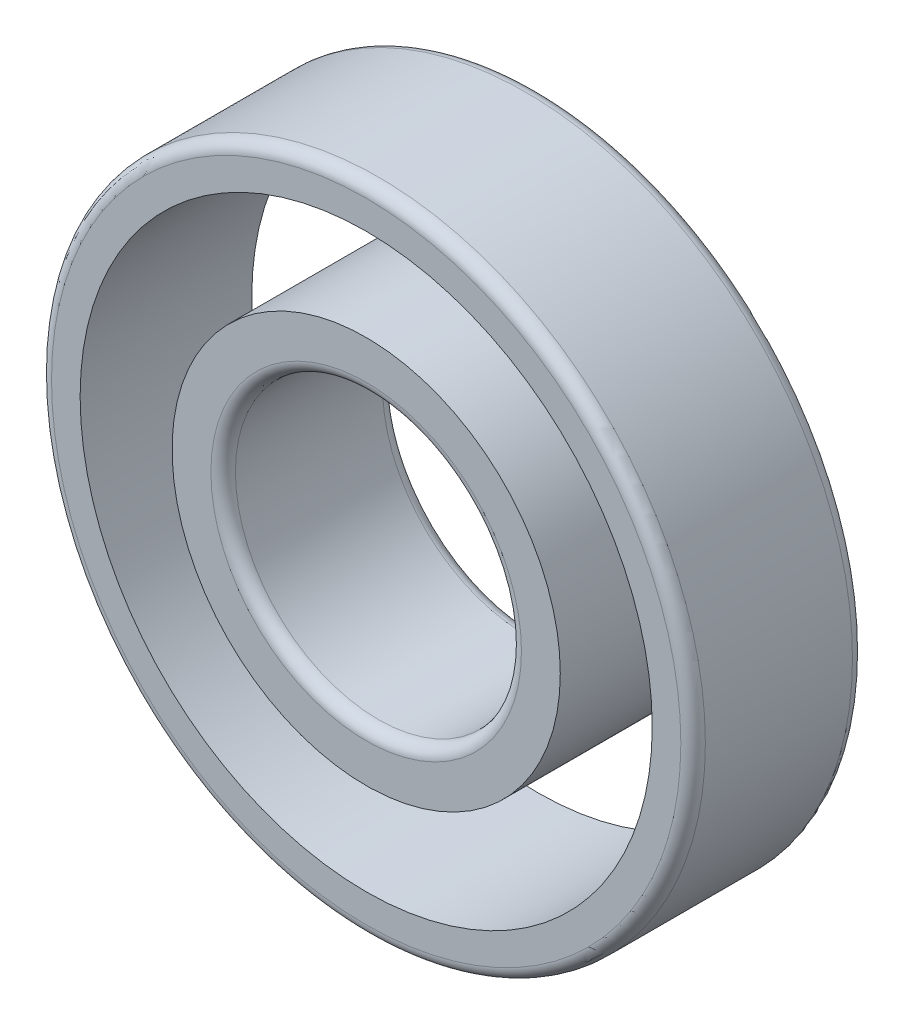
from build123d import *

# Parameters (mm, degrees)
SKETCH_1_W   = 21
SKETCH_1_H   = 6.25
SKETCH_1_H_2 = 5
FILLET_1_R   = 1.5
FILLET_2_R   = 1.5


with BuildPart() as part:
    # Sketch 1 → Revolve 1 (revolve)
    with BuildSketch(Plane(origin=(0, 0, 0), x_dir=(0, 0, -1), z_dir=(1, 0, 0)), mode=Mode.PRIVATE) as revolve_1_sk:
        with Locations((10.5, 20.625)):
            Rectangle(SKETCH_1_W, SKETCH_1_H)
        with Locations((10.5, 37.5)):
            Rectangle(SKETCH_1_W, SKETCH_1_H_2)
    revolve(revolve_1_sk.sketch.rotate(Axis((0, 0, 0), (0, 0, -1)), 90), axis=Axis((0, 0, 0), (0, 0, -1)))

    # Fillet 1
    fillet_1_edges = [part.edges().sort_by_distance(p)[0] for p in [
        (-40, 0, -21),
        (-40, 0, 0),
    ]]
    fillet(fillet_1_edges, radius=FILLET_1_R)

    # Fillet 2
    fillet_2_edges = [part.edges().sort_by_distance(p)[0] for p in [
        (-17.5, 0, -21),
        (-17.5, 0, 0),
    ]]
    fillet(fillet_2_edges, radius=FILLET_2_R)


solid = part.part
